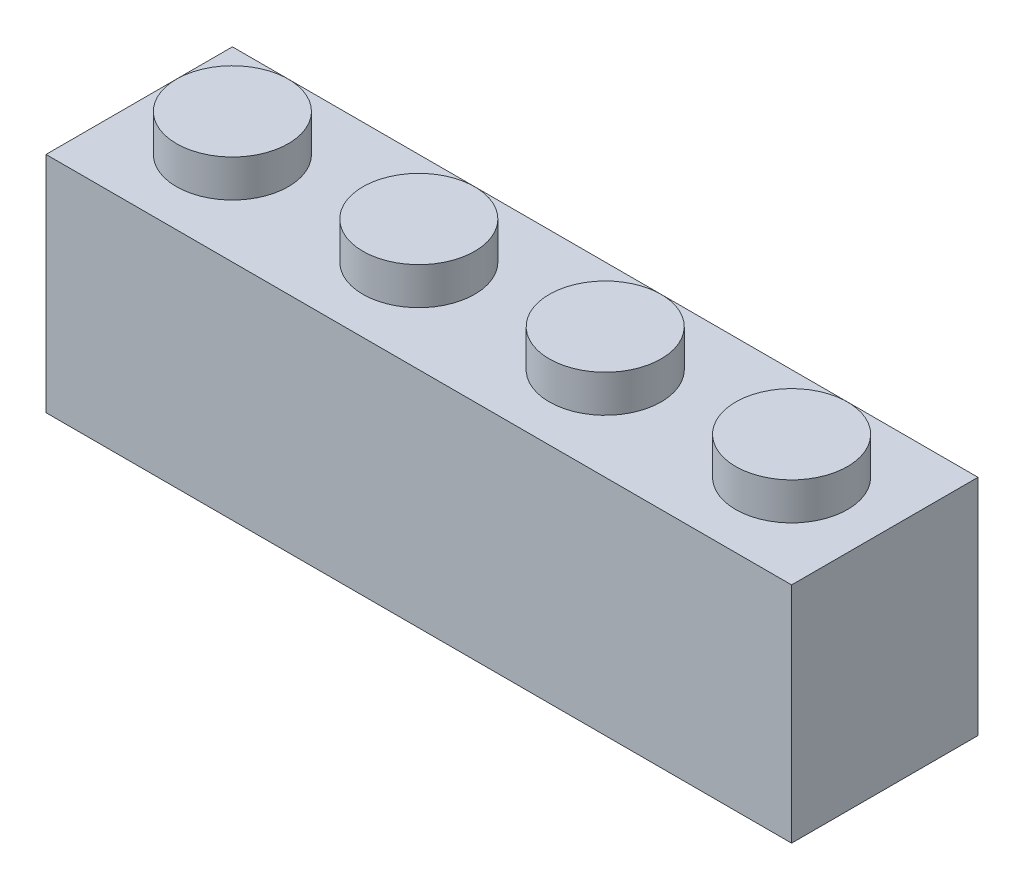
from build123d import *

# Parameters (mm, degrees)
BOSS_EXTRUDE1_DEPTH      = 4
BOSS_EXTRUDE1_DEPTH_BACK = 4
SKETCH1_W                = 32
SKETCH1_H                = 9.6
SKETCH2_R                = 2.4
BOSS_EXTRUDE2_DEPTH      = 1.6
SHELL1_T                 = -1.6
SKETCH4_R                = 1.6
BOSS_EXTRUDE3_DEPTH      = 8
LPATTERN1_COUNT          = 3
LPATTERN1_PITCH          = 8


with BuildPart() as part:
    # Sketch1 → Boss-Extrude1 (new, two sides: drawn at the far end of the back side and taken through both)
    with BuildSketch(Plane.XY.offset(-BOSS_EXTRUDE1_DEPTH_BACK)):
        Rectangle(SKETCH1_W, SKETCH1_H)
    extrude(amount=BOSS_EXTRUDE1_DEPTH + BOSS_EXTRUDE1_DEPTH_BACK)

    # Sketch2 → Boss-Extrude2 (add)
    with BuildSketch(Plane(origin=(0, 4.8, 0), x_dir=(1, 0, 0), z_dir=(0, 1, 0))):
        with Locations(Location((-12, 0, 0), (0, 0, 270))):
            Circle(SKETCH2_R)
        with Locations(Location((-4, 0, 0), (0, 0, 270))):
            Circle(SKETCH2_R)
        with Locations(Location((4, 0, 0), (0, 0, 270))):
            Circle(SKETCH2_R)
        with Locations(Location((12, 0, 0), (0, 0, 270))):
            Circle(SKETCH2_R)
    extrude(amount=BOSS_EXTRUDE2_DEPTH)

    # Shell1
    shell1_openings = [part.faces().sort_by_distance(p)[0] for p in [
        (0, -4.8, 0),
    ]]
    offset(amount=SHELL1_T, openings=shell1_openings, kind=Kind.INTERSECTION)

    # Sketch4 → Boss-Extrude3 (add)
    with BuildSketch(Plane.XZ.offset(4.8)):
        with Locations(Location((-8, 0, 0), (0, 0, 270))):
            Circle(SKETCH4_R)
    boss_extrude3 = extrude(amount=-BOSS_EXTRUDE3_DEPTH)

    # LPattern1: Boss-Extrude3 ×3
    with Locations(*[(i * LPATTERN1_PITCH, 0, 0) for i in range(1, LPATTERN1_COUNT)]):
        add(boss_extrude3)


solid = part.part
